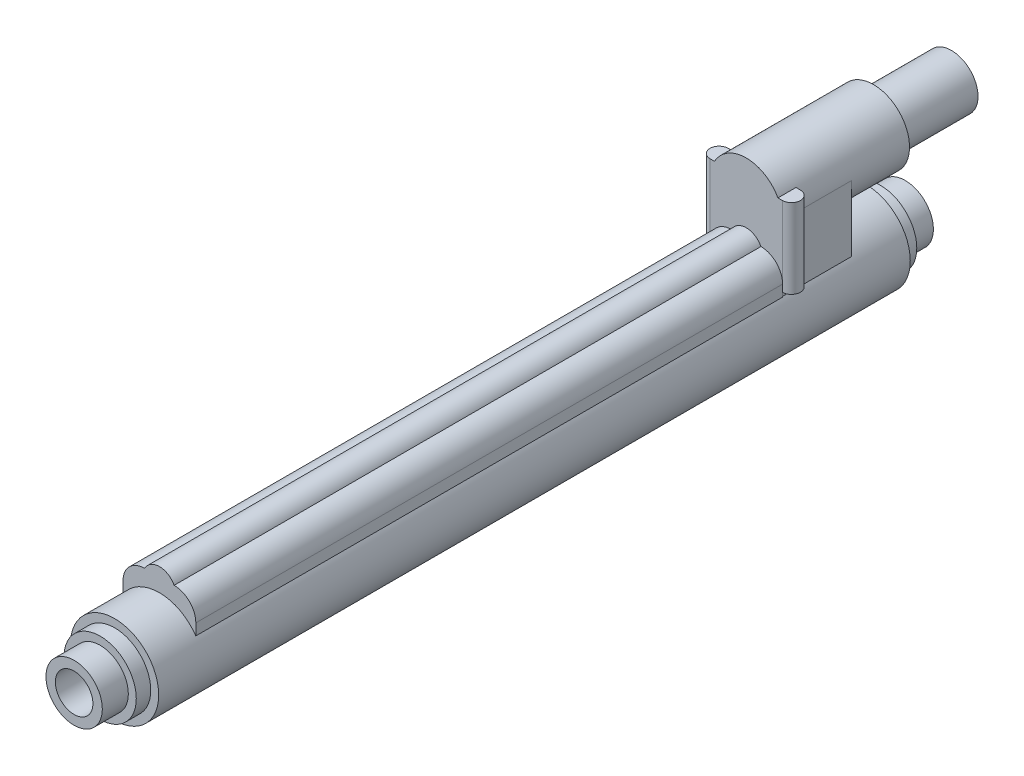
ISO-10303-21;
HEADER;
FILE_DESCRIPTION(('STEP AP214'),'2;1');
FILE_NAME('part.step','',(''),(''),'','','');
FILE_SCHEMA(('AUTOMOTIVE_DESIGN { 1 0 10303 214 1 1 1 1 }'));
ENDSEC;
DATA;
#1=APPLICATION_CONTEXT('core data for automotive mechanical design processes');
#2=APPLICATION_PROTOCOL_DEFINITION('international standard','automotive_design',2000,#1);
#3=PRODUCT_CONTEXT('',#1,'mechanical');
#4=PRODUCT('Part','Part','',(#3));
#5=PRODUCT_RELATED_PRODUCT_CATEGORY('part','',(#4));
#6=PRODUCT_DEFINITION_FORMATION('','',#4);
#7=PRODUCT_DEFINITION_CONTEXT('part definition',#1,'design');
#8=PRODUCT_DEFINITION('design','',#6,#7);
#9=PRODUCT_DEFINITION_SHAPE('','',#8);
#10=(LENGTH_UNIT() NAMED_UNIT(*) SI_UNIT(.MILLI.,.METRE.));
#11=(NAMED_UNIT(*) PLANE_ANGLE_UNIT() SI_UNIT($,.RADIAN.));
#12=(NAMED_UNIT(*) SI_UNIT($,.STERADIAN.) SOLID_ANGLE_UNIT());
#13=UNCERTAINTY_MEASURE_WITH_UNIT(LENGTH_MEASURE(1.E-05),#10,'distance_accuracy_value','');
#14=(GEOMETRIC_REPRESENTATION_CONTEXT(3) GLOBAL_UNCERTAINTY_ASSIGNED_CONTEXT((#13)) GLOBAL_UNIT_ASSIGNED_CONTEXT((#10,
#11,#12)) REPRESENTATION_CONTEXT('',''));
#15=CARTESIAN_POINT('',(0.,0.,0.));
#16=DIRECTION('',(0.,0.,1.));
#17=DIRECTION('',(1.,0.,0.));
#18=AXIS2_PLACEMENT_3D('',#15,#16,#17);
#19=CARTESIAN_POINT('',(6.35,16.002,27.94));
#20=DIRECTION('',(-1.,0.,0.));
#21=DIRECTION('',(0.,0.,1.));
#22=AXIS2_PLACEMENT_3D('',#19,#20,#21);
#23=PLANE('',#22);
#24=DIRECTION('',(0.,-1.,0.));
#25=VECTOR('',#24,1.);
#26=CARTESIAN_POINT('',(6.35000000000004,19.05,24.765));
#27=LINE('',#26,#25);
#28=CARTESIAN_POINT('',(6.35000000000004,16.002,24.765));
#29=VERTEX_POINT('',#28);
#30=CARTESIAN_POINT('',(6.35000000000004,5.08,24.765));
#31=VERTEX_POINT('',#30);
#32=EDGE_CURVE('E165',#29,#31,#27,.T.);
#33=ORIENTED_EDGE('',*,*,#32,.T.);
#34=DIRECTION('',(0.,0.,-1.));
#35=VECTOR('',#34,1.);
#36=CARTESIAN_POINT('',(6.35,5.08,27.94));
#37=LINE('',#36,#35);
#38=CARTESIAN_POINT('',(6.35,5.08,27.94));
#39=VERTEX_POINT('',#38);
#40=EDGE_CURVE('E150',#39,#31,#37,.T.);
#41=ORIENTED_EDGE('',*,*,#40,.F.);
#42=DIRECTION('',(0.,1.,0.));
#43=VECTOR('',#42,1.);
#44=CARTESIAN_POINT('',(6.35,16.002,27.94));
#45=LINE('',#44,#43);
#46=CARTESIAN_POINT('',(6.35,4.43773692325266,27.94));
#47=VERTEX_POINT('',#46);
#48=EDGE_CURVE('E249',#47,#39,#45,.T.);
#49=ORIENTED_EDGE('',*,*,#48,.F.);
#50=DIRECTION('',(0.,0.,-1.));
#51=VECTOR('',#50,1.);
#52=CARTESIAN_POINT('',(6.35,4.43773692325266,27.94));
#53=LINE('',#52,#51);
#54=CARTESIAN_POINT('',(6.35,4.43773692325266,15.748));
#55=VERTEX_POINT('',#54);
#56=EDGE_CURVE('E264',#47,#55,#53,.T.);
#57=ORIENTED_EDGE('',*,*,#56,.T.);
#58=DIRECTION('',(0.,1.,0.));
#59=VECTOR('',#58,1.);
#60=CARTESIAN_POINT('',(6.35,16.002,15.748));
#61=LINE('',#60,#59);
#62=CARTESIAN_POINT('',(6.35,16.002,15.748));
#63=VERTEX_POINT('',#62);
#64=EDGE_CURVE('E243',#55,#63,#61,.T.);
#65=ORIENTED_EDGE('',*,*,#64,.T.);
#66=DIRECTION('',(0.,0.,-1.));
#67=VECTOR('',#66,1.);
#68=CARTESIAN_POINT('',(6.35,16.002,27.94));
#69=LINE('',#68,#67);
#70=EDGE_CURVE('E172',#29,#63,#69,.T.);
#71=ORIENTED_EDGE('',*,*,#70,.F.);
#72=EDGE_LOOP('',(#33,#41,#49,#57,#65,#71));
#73=FACE_BOUND('',#72,.T.);
#74=ADVANCED_FACE('F31',(#73),#23,.F.);
#75=CARTESIAN_POINT('',(0.,16.002,27.94));
#76=DIRECTION('',(0.,0.,-1.));
#77=DIRECTION('',(-1.,0.,0.));
#78=AXIS2_PLACEMENT_3D('',#75,#76,#77);
#79=CYLINDRICAL_SURFACE('',#78,6.35);
#80=CARTESIAN_POINT('',(0.,16.002,5.588));
#81=DIRECTION('',(0.,0.,-1.));
#82=DIRECTION('',(-1.,0.,0.));
#83=AXIS2_PLACEMENT_3D('',#80,#81,#82);
#84=CIRCLE('',#83,6.35);
#85=CARTESIAN_POINT('',(-6.35,16.002,5.588));
#86=VERTEX_POINT('',#85);
#87=EDGE_CURVE('E193',#86,#86,#84,.T.);
#88=ORIENTED_EDGE('',*,*,#87,.F.);
#89=EDGE_LOOP('',(#88));
#90=FACE_BOUND('',#89,.T.);
#91=CARTESIAN_POINT('',(0.,16.002,24.765));
#92=DIRECTION('',(0.,0.,1.));
#93=DIRECTION('',(1.,0.,0.));
#94=AXIS2_PLACEMENT_3D('',#91,#92,#93);
#95=CIRCLE('',#94,6.35);
#96=CARTESIAN_POINT('',(5.57065489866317,19.05,24.765));
#97=VERTEX_POINT('',#96);
#98=EDGE_CURVE('E183',#29,#97,#95,.T.);
#99=ORIENTED_EDGE('',*,*,#98,.F.);
#100=ORIENTED_EDGE('',*,*,#70,.T.);
#101=CARTESIAN_POINT('',(0.,16.002,15.748));
#102=DIRECTION('',(0.,0.,-1.));
#103=DIRECTION('',(-1.,0.,0.));
#104=AXIS2_PLACEMENT_3D('',#101,#102,#103);
#105=CIRCLE('',#104,6.35);
#106=CARTESIAN_POINT('',(-6.35,16.002,15.748));
#107=VERTEX_POINT('',#106);
#108=EDGE_CURVE('E190',#63,#107,#105,.T.);
#109=ORIENTED_EDGE('',*,*,#108,.T.);
#110=DIRECTION('',(0.,0.,-1.));
#111=VECTOR('',#110,1.);
#112=CARTESIAN_POINT('',(-6.35,16.002,27.94));
#113=LINE('',#112,#111);
#114=CARTESIAN_POINT('',(-6.35,16.002,24.765));
#115=VERTEX_POINT('',#114);
#116=EDGE_CURVE('E261',#115,#107,#113,.T.);
#117=ORIENTED_EDGE('',*,*,#116,.F.);
#118=CARTESIAN_POINT('',(-5.57065489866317,19.05,24.765));
#119=VERTEX_POINT('',#118);
#120=EDGE_CURVE('E158',#119,#115,#95,.T.);
#121=ORIENTED_EDGE('',*,*,#120,.F.);
#122=DIRECTION('',(0.,0.,-1.));
#123=VECTOR('',#122,1.);
#124=CARTESIAN_POINT('',(-5.57065489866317,19.05,27.94));
#125=LINE('',#124,#123);
#126=CARTESIAN_POINT('',(-5.57065489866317,19.05,27.94));
#127=VERTEX_POINT('',#126);
#128=EDGE_CURVE('E39',#119,#127,#125,.F.);
#129=ORIENTED_EDGE('',*,*,#128,.T.);
#130=CARTESIAN_POINT('',(0.,16.002,27.94));
#131=DIRECTION('',(0.,0.,1.));
#132=DIRECTION('',(1.,0.,0.));
#133=AXIS2_PLACEMENT_3D('',#130,#131,#132);
#134=CIRCLE('',#133,6.35);
#135=CARTESIAN_POINT('',(5.57065489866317,19.05,27.94));
#136=VERTEX_POINT('',#135);
#137=EDGE_CURVE('E251',#136,#127,#134,.T.);
#138=ORIENTED_EDGE('',*,*,#137,.F.);
#139=DIRECTION('',(0.,0.,-1.));
#140=VECTOR('',#139,1.);
#141=CARTESIAN_POINT('',(5.57065489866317,19.05,27.94));
#142=LINE('',#141,#140);
#143=EDGE_CURVE('E11',#136,#97,#142,.T.);
#144=ORIENTED_EDGE('',*,*,#143,.T.);
#145=EDGE_LOOP('',(#99,#100,#109,#117,#121,#129,#138,#144));
#146=FACE_BOUND('',#145,.T.);
#147=ADVANCED_FACE('F312',(#90,#146),#79,.T.);
#148=CARTESIAN_POINT('',(-6.35,16.002,27.94));
#149=DIRECTION('',(1.,0.,0.));
#150=DIRECTION('',(0.,1.,0.));
#151=AXIS2_PLACEMENT_3D('',#148,#149,#150);
#152=PLANE('',#151);
#153=DIRECTION('',(0.,-1.,0.));
#154=VECTOR('',#153,1.);
#155=CARTESIAN_POINT('',(-6.35,19.05,24.765));
#156=LINE('',#155,#154);
#157=CARTESIAN_POINT('',(-6.35,5.08,24.765));
#158=VERTEX_POINT('',#157);
#159=EDGE_CURVE('E177',#115,#158,#156,.T.);
#160=ORIENTED_EDGE('',*,*,#159,.F.);
#161=ORIENTED_EDGE('',*,*,#116,.T.);
#162=DIRECTION('',(0.,-1.,0.));
#163=VECTOR('',#162,1.);
#164=CARTESIAN_POINT('',(-6.35,16.002,15.748));
#165=LINE('',#164,#163);
#166=CARTESIAN_POINT('',(-6.35,4.43773692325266,15.748));
#167=VERTEX_POINT('',#166);
#168=EDGE_CURVE('E245',#107,#167,#165,.T.);
#169=ORIENTED_EDGE('',*,*,#168,.T.);
#170=DIRECTION('',(0.,0.,-1.));
#171=VECTOR('',#170,1.);
#172=CARTESIAN_POINT('',(-6.35,4.43773692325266,27.94));
#173=LINE('',#172,#171);
#174=CARTESIAN_POINT('',(-6.35,4.43773692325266,27.94));
#175=VERTEX_POINT('',#174);
#176=EDGE_CURVE('E258',#175,#167,#173,.T.);
#177=ORIENTED_EDGE('',*,*,#176,.F.);
#178=DIRECTION('',(0.,-1.,0.));
#179=VECTOR('',#178,1.);
#180=CARTESIAN_POINT('',(-6.35,16.002,27.94));
#181=LINE('',#180,#179);
#182=CARTESIAN_POINT('',(-6.35,5.08,27.94));
#183=VERTEX_POINT('',#182);
#184=EDGE_CURVE('E254',#183,#175,#181,.T.);
#185=ORIENTED_EDGE('',*,*,#184,.F.);
#186=DIRECTION('',(0.,0.,1.));
#187=VECTOR('',#186,1.);
#188=CARTESIAN_POINT('',(-6.35,5.08,27.94));
#189=LINE('',#188,#187);
#190=EDGE_CURVE('E159',#158,#183,#189,.T.);
#191=ORIENTED_EDGE('',*,*,#190,.F.);
#192=EDGE_LOOP('',(#160,#161,#169,#177,#185,#191));
#193=FACE_BOUND('',#192,.T.);
#194=ADVANCED_FACE('F343',(#193),#152,.F.);
#195=CARTESIAN_POINT('',(0.,16.002,5.588));
#196=DIRECTION('',(0.,0.,-1.));
#197=DIRECTION('',(-1.,0.,0.));
#198=AXIS2_PLACEMENT_3D('',#195,#196,#197);
#199=PLANE('',#198);
#200=ORIENTED_EDGE('',*,*,#87,.T.);
#201=EDGE_LOOP('',(#200));
#202=FACE_BOUND('',#201,.T.);
#203=CARTESIAN_POINT('',(0.,16.002,5.588));
#204=DIRECTION('',(0.,0.,-1.));
#205=DIRECTION('',(-1.,0.,0.));
#206=AXIS2_PLACEMENT_3D('',#203,#204,#205);
#207=CIRCLE('',#206,4.6736);
#208=CARTESIAN_POINT('',(-4.6736,16.002,5.588));
#209=VERTEX_POINT('',#208);
#210=EDGE_CURVE('E184',#209,#209,#207,.T.);
#211=ORIENTED_EDGE('',*,*,#210,.F.);
#212=EDGE_LOOP('',(#211));
#213=FACE_BOUND('',#212,.T.);
#214=ADVANCED_FACE('F558',(#202,#213),#199,.T.);
#215=CARTESIAN_POINT('',(0.,16.002,15.748));
#216=DIRECTION('',(0.,0.,1.));
#217=DIRECTION('',(1.,0.,0.));
#218=AXIS2_PLACEMENT_3D('',#215,#216,#217);
#219=PLANE('',#218);
#220=ORIENTED_EDGE('',*,*,#108,.F.);
#221=ORIENTED_EDGE('',*,*,#64,.F.);
#222=CARTESIAN_POINT('',(0.,0.,15.748));
#223=DIRECTION('',(0.,0.,1.));
#224=DIRECTION('',(1.,0.,0.));
#225=AXIS2_PLACEMENT_3D('',#222,#223,#224);
#226=CIRCLE('',#225,7.747);
#227=EDGE_CURVE('E301',#55,#167,#226,.T.);
#228=ORIENTED_EDGE('',*,*,#227,.T.);
#229=ORIENTED_EDGE('',*,*,#168,.F.);
#230=EDGE_LOOP('',(#220,#221,#228,#229));
#231=FACE_BOUND('',#230,.T.);
#232=ADVANCED_FACE('F380',(#231),#219,.F.);
#233=CARTESIAN_POINT('',(0.,16.002,27.94));
#234=DIRECTION('',(0.,0.,1.));
#235=DIRECTION('',(1.,0.,0.));
#236=AXIS2_PLACEMENT_3D('',#233,#234,#235);
#237=PLANE('',#236);
#238=ORIENTED_EDGE('',*,*,#137,.T.);
#239=DIRECTION('',(1.,0.,0.));
#240=VECTOR('',#239,1.);
#241=CARTESIAN_POINT('',(6.35,19.05,27.94));
#242=LINE('',#241,#240);
#243=CARTESIAN_POINT('',(-6.35,19.05,27.94));
#244=VERTEX_POINT('',#243);
#245=EDGE_CURVE('E320',#244,#127,#242,.T.);
#246=ORIENTED_EDGE('',*,*,#245,.F.);
#247=CARTESIAN_POINT('',(-6.35,6.96999131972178,27.94));
#248=VERTEX_POINT('',#247);
#249=EDGE_CURVE('E255',#244,#248,#181,.T.);
#250=ORIENTED_EDGE('',*,*,#249,.T.);
#251=CARTESIAN_POINT('',(-2.59078322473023,6.34999999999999,27.94));
#252=DIRECTION('',(0.,0.,1.));
#253=DIRECTION('',(-1.,0.,0.));
#254=AXIS2_PLACEMENT_3D('',#251,#252,#253);
#255=CIRCLE('',#254,3.81);
#256=CARTESIAN_POINT('',(-2.59078322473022,10.16,27.94));
#257=VERTEX_POINT('',#256);
#258=EDGE_CURVE('E204',#257,#248,#255,.T.);
#259=ORIENTED_EDGE('',*,*,#258,.F.);
#260=CARTESIAN_POINT('',(0.,8.79841256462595,27.94));
#261=DIRECTION('',(0.,0.,1.));
#262=DIRECTION('',(-1.,0.,0.));
#263=AXIS2_PLACEMENT_3D('',#260,#261,#262);
#264=CIRCLE('',#263,2.92678630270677);
#265=CARTESIAN_POINT('',(2.59078322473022,10.16,27.94));
#266=VERTEX_POINT('',#265);
#267=EDGE_CURVE('E200',#266,#257,#264,.T.);
#268=ORIENTED_EDGE('',*,*,#267,.F.);
#269=CARTESIAN_POINT('',(2.59078322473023,6.34999999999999,27.94));
#270=DIRECTION('',(0.,0.,1.));
#271=DIRECTION('',(1.,0.,0.));
#272=AXIS2_PLACEMENT_3D('',#269,#270,#271);
#273=CIRCLE('',#272,3.81);
#274=CARTESIAN_POINT('',(6.35,6.96999131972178,27.94));
#275=VERTEX_POINT('',#274);
#276=EDGE_CURVE('E196',#275,#266,#273,.T.);
#277=ORIENTED_EDGE('',*,*,#276,.F.);
#278=CARTESIAN_POINT('',(6.35,19.05,27.94));
#279=VERTEX_POINT('',#278);
#280=EDGE_CURVE('E248',#275,#279,#45,.T.);
#281=ORIENTED_EDGE('',*,*,#280,.T.);
#282=EDGE_CURVE('E322',#136,#279,#242,.T.);
#283=ORIENTED_EDGE('',*,*,#282,.F.);
#284=EDGE_LOOP('',(#238,#246,#250,#259,#268,#277,#281,#283));
#285=FACE_BOUND('',#284,.T.);
#286=ADVANCED_FACE('F319',(#285),#237,.T.);
#287=CARTESIAN_POINT('',(0.,0.,138.938));
#288=DIRECTION('',(0.,0.,1.));
#289=DIRECTION('',(1.,0.,0.));
#290=AXIS2_PLACEMENT_3D('',#287,#288,#289);
#291=PLANE('',#290);
#292=CARTESIAN_POINT('',(0.,0.,138.938));
#293=DIRECTION('',(0.,0.,1.));
#294=DIRECTION('',(1.,0.,0.));
#295=AXIS2_PLACEMENT_3D('',#292,#293,#294);
#296=CIRCLE('',#295,7.747);
#297=CARTESIAN_POINT('',(7.747,0.,138.938));
#298=VERTEX_POINT('',#297);
#299=EDGE_CURVE('E287',#298,#298,#296,.T.);
#300=ORIENTED_EDGE('',*,*,#299,.T.);
#301=EDGE_LOOP('',(#300));
#302=FACE_BOUND('',#301,.T.);
#303=CARTESIAN_POINT('',(0.,0.,138.938));
#304=DIRECTION('',(0.,0.,1.));
#305=DIRECTION('',(1.,0.,0.));
#306=AXIS2_PLACEMENT_3D('',#303,#304,#305);
#307=CIRCLE('',#306,6.35);
#308=CARTESIAN_POINT('',(6.35,0.,138.938));
#309=VERTEX_POINT('',#308);
#310=EDGE_CURVE('E273',#309,#309,#307,.T.);
#311=ORIENTED_EDGE('',*,*,#310,.F.);
#312=EDGE_LOOP('',(#311));
#313=FACE_BOUND('',#312,.T.);
#314=ADVANCED_FACE('F435',(#302,#313),#291,.T.);
#315=CARTESIAN_POINT('',(0.,0.,6.858));
#316=DIRECTION('',(0.,0.,1.));
#317=DIRECTION('',(1.,0.,0.));
#318=AXIS2_PLACEMENT_3D('',#315,#316,#317);
#319=PLANE('',#318);
#320=CARTESIAN_POINT('',(0.,0.,6.858));
#321=DIRECTION('',(0.,0.,1.));
#322=DIRECTION('',(1.,0.,0.));
#323=AXIS2_PLACEMENT_3D('',#320,#321,#322);
#324=CIRCLE('',#323,7.747);
#325=CARTESIAN_POINT('',(7.747,0.,6.858));
#326=VERTEX_POINT('',#325);
#327=EDGE_CURVE('E284',#326,#326,#324,.T.);
#328=ORIENTED_EDGE('',*,*,#327,.F.);
#329=EDGE_LOOP('',(#328));
#330=FACE_BOUND('',#329,.T.);
#331=CARTESIAN_POINT('',(0.,0.,6.858));
#332=DIRECTION('',(0.,0.,1.));
#333=DIRECTION('',(1.,0.,0.));
#334=AXIS2_PLACEMENT_3D('',#331,#332,#333);
#335=CIRCLE('',#334,6.35);
#336=CARTESIAN_POINT('',(6.35,0.,6.858));
#337=VERTEX_POINT('',#336);
#338=EDGE_CURVE('E296',#337,#337,#335,.F.);
#339=ORIENTED_EDGE('',*,*,#338,.F.);
#340=EDGE_LOOP('',(#339));
#341=FACE_BOUND('',#340,.T.);
#342=ADVANCED_FACE('F432',(#330,#341),#319,.F.);
#343=CARTESIAN_POINT('',(0.,0.,138.938));
#344=DIRECTION('',(0.,0.,-1.));
#345=DIRECTION('',(-1.,0.,0.));
#346=AXIS2_PLACEMENT_3D('',#343,#344,#345);
#347=CYLINDRICAL_SURFACE('',#346,7.747);
#348=DIRECTION('',(0.,0.,-1.));
#349=VECTOR('',#348,1.);
#350=CARTESIAN_POINT('',(6.40078322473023,4.36417038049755,131.064));
#351=LINE('',#350,#349);
#352=CARTESIAN_POINT('',(6.40078322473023,4.36417038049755,131.064));
#353=VERTEX_POINT('',#352);
#354=CARTESIAN_POINT('',(6.40078322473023,4.36417038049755,27.94));
#355=VERTEX_POINT('',#354);
#356=EDGE_CURVE('E54',#353,#355,#351,.T.);
#357=ORIENTED_EDGE('',*,*,#356,.F.);
#358=CARTESIAN_POINT('',(0.,0.,131.064));
#359=DIRECTION('',(0.,0.,1.));
#360=DIRECTION('',(1.,0.,0.));
#361=AXIS2_PLACEMENT_3D('',#358,#359,#360);
#362=CIRCLE('',#361,7.747);
#363=CARTESIAN_POINT('',(-6.40078322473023,4.36417038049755,131.064));
#364=VERTEX_POINT('',#363);
#365=EDGE_CURVE('E306',#353,#364,#362,.T.);
#366=ORIENTED_EDGE('',*,*,#365,.T.);
#367=DIRECTION('',(0.,0.,-1.));
#368=VECTOR('',#367,1.);
#369=CARTESIAN_POINT('',(-6.40078322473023,4.36417038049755,131.064));
#370=LINE('',#369,#368);
#371=CARTESIAN_POINT('',(-6.40078322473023,4.36417038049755,27.94));
#372=VERTEX_POINT('',#371);
#373=EDGE_CURVE('E228',#364,#372,#370,.T.);
#374=ORIENTED_EDGE('',*,*,#373,.T.);
#375=CARTESIAN_POINT('',(0.,0.,27.94));
#376=DIRECTION('',(0.,0.,1.));
#377=DIRECTION('',(1.,0.,0.));
#378=AXIS2_PLACEMENT_3D('',#375,#376,#377);
#379=CIRCLE('',#378,7.747);
#380=EDGE_CURVE('E239',#175,#372,#379,.T.);
#381=ORIENTED_EDGE('',*,*,#380,.F.);
#382=ORIENTED_EDGE('',*,*,#176,.T.);
#383=ORIENTED_EDGE('',*,*,#227,.F.);
#384=ORIENTED_EDGE('',*,*,#56,.F.);
#385=EDGE_CURVE('E242',#355,#47,#379,.T.);
#386=ORIENTED_EDGE('',*,*,#385,.F.);
#387=EDGE_LOOP('',(#357,#366,#374,#381,#382,#383,#384,#386));
#388=FACE_BOUND('',#387,.T.);
#389=ORIENTED_EDGE('',*,*,#299,.F.);
#390=EDGE_LOOP('',(#389));
#391=FACE_BOUND('',#390,.T.);
#392=ORIENTED_EDGE('',*,*,#327,.T.);
#393=EDGE_LOOP('',(#392));
#394=FACE_BOUND('',#393,.T.);
#395=ADVANCED_FACE('F375',(#388,#391,#394),#347,.T.);
#396=CARTESIAN_POINT('',(0.,0.,4.318));
#397=DIRECTION('',(0.,0.,-1.));
#398=DIRECTION('',(-1.,0.,0.));
#399=AXIS2_PLACEMENT_3D('',#396,#397,#398);
#400=PLANE('',#399);
#401=CARTESIAN_POINT('',(0.,0.,4.318));
#402=DIRECTION('',(0.,0.,-1.));
#403=DIRECTION('',(-1.,0.,0.));
#404=AXIS2_PLACEMENT_3D('',#401,#402,#403);
#405=CIRCLE('',#404,6.35);
#406=CARTESIAN_POINT('',(-6.35,0.,4.318));
#407=VERTEX_POINT('',#406);
#408=EDGE_CURVE('E280',#407,#407,#405,.T.);
#409=ORIENTED_EDGE('',*,*,#408,.T.);
#410=EDGE_LOOP('',(#409));
#411=FACE_BOUND('',#410,.T.);
#412=CARTESIAN_POINT('',(0.,0.,4.31799999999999));
#413=DIRECTION('',(0.,0.,-1.));
#414=DIRECTION('',(-1.,0.,0.));
#415=AXIS2_PLACEMENT_3D('',#412,#413,#414);
#416=CIRCLE('',#415,4.953);
#417=CARTESIAN_POINT('',(-4.953,0.,4.31799999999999));
#418=VERTEX_POINT('',#417);
#419=EDGE_CURVE('E283',#418,#418,#416,.T.);
#420=ORIENTED_EDGE('',*,*,#419,.F.);
#421=EDGE_LOOP('',(#420));
#422=FACE_BOUND('',#421,.T.);
#423=ADVANCED_FACE('F423',(#411,#422),#400,.T.);
#424=CARTESIAN_POINT('',(0.,0.,4.318));
#425=DIRECTION('',(0.,0.,1.));
#426=DIRECTION('',(1.,0.,0.));
#427=AXIS2_PLACEMENT_3D('',#424,#425,#426);
#428=CYLINDRICAL_SURFACE('',#427,6.35);
#429=ORIENTED_EDGE('',*,*,#408,.F.);
#430=EDGE_LOOP('',(#429));
#431=FACE_BOUND('',#430,.T.);
#432=ORIENTED_EDGE('',*,*,#338,.T.);
#433=EDGE_LOOP('',(#432));
#434=FACE_BOUND('',#433,.T.);
#435=ADVANCED_FACE('F426',(#431,#434),#428,.T.);
#436=CARTESIAN_POINT('',(0.,0.,0.));
#437=DIRECTION('',(0.,0.,1.));
#438=DIRECTION('',(1.,0.,0.));
#439=AXIS2_PLACEMENT_3D('',#436,#437,#438);
#440=PLANE('',#439);
#441=CARTESIAN_POINT('',(0.,0.,0.));
#442=DIRECTION('',(0.,0.,-1.));
#443=DIRECTION('',(-1.,0.,0.));
#444=AXIS2_PLACEMENT_3D('',#441,#442,#443);
#445=CIRCLE('',#444,3.302);
#446=CARTESIAN_POINT('',(-3.302,0.,0.));
#447=VERTEX_POINT('',#446);
#448=EDGE_CURVE('E267',#447,#447,#445,.T.);
#449=ORIENTED_EDGE('',*,*,#448,.F.);
#450=EDGE_LOOP('',(#449));
#451=FACE_BOUND('',#450,.T.);
#452=CARTESIAN_POINT('',(0.,0.,0.));
#453=DIRECTION('',(0.,0.,1.));
#454=DIRECTION('',(1.,0.,0.));
#455=AXIS2_PLACEMENT_3D('',#452,#453,#454);
#456=CIRCLE('',#455,4.953);
#457=CARTESIAN_POINT('',(4.953,0.,0.));
#458=VERTEX_POINT('',#457);
#459=EDGE_CURVE('E290',#458,#458,#456,.T.);
#460=ORIENTED_EDGE('',*,*,#459,.F.);
#461=EDGE_LOOP('',(#460));
#462=FACE_BOUND('',#461,.T.);
#463=ADVANCED_FACE('F430',(#451,#462),#440,.F.);
#464=CARTESIAN_POINT('',(0.,0.,146.05));
#465=DIRECTION('',(0.,0.,-1.));
#466=DIRECTION('',(-1.,0.,0.));
#467=AXIS2_PLACEMENT_3D('',#464,#465,#466);
#468=CYLINDRICAL_SURFACE('',#467,4.953);
#469=ORIENTED_EDGE('',*,*,#419,.T.);
#470=EDGE_LOOP('',(#469));
#471=FACE_BOUND('',#470,.T.);
#472=ORIENTED_EDGE('',*,*,#459,.T.);
#473=EDGE_LOOP('',(#472));
#474=FACE_BOUND('',#473,.T.);
#475=ADVANCED_FACE('F417',(#471,#474),#468,.T.);
#476=CARTESIAN_POINT('',(0.,0.,141.478));
#477=DIRECTION('',(0.,0.,1.));
#478=DIRECTION('',(1.,0.,0.));
#479=AXIS2_PLACEMENT_3D('',#476,#477,#478);
#480=PLANE('',#479);
#481=CARTESIAN_POINT('',(0.,0.,141.478));
#482=DIRECTION('',(0.,0.,1.));
#483=DIRECTION('',(1.,0.,0.));
#484=AXIS2_PLACEMENT_3D('',#481,#482,#483);
#485=CIRCLE('',#484,6.35);
#486=CARTESIAN_POINT('',(6.35,0.,141.478));
#487=VERTEX_POINT('',#486);
#488=EDGE_CURVE('E276',#487,#487,#485,.T.);
#489=ORIENTED_EDGE('',*,*,#488,.T.);
#490=EDGE_LOOP('',(#489));
#491=FACE_BOUND('',#490,.T.);
#492=CARTESIAN_POINT('',(0.,0.,141.478));
#493=DIRECTION('',(0.,0.,1.));
#494=DIRECTION('',(1.,0.,0.));
#495=AXIS2_PLACEMENT_3D('',#492,#493,#494);
#496=CIRCLE('',#495,4.953);
#497=CARTESIAN_POINT('',(4.953,0.,141.478));
#498=VERTEX_POINT('',#497);
#499=EDGE_CURVE('E279',#498,#498,#496,.T.);
#500=ORIENTED_EDGE('',*,*,#499,.F.);
#501=EDGE_LOOP('',(#500));
#502=FACE_BOUND('',#501,.T.);
#503=ADVANCED_FACE('F413',(#491,#502),#480,.T.);
#504=CARTESIAN_POINT('',(0.,0.,141.478));
#505=DIRECTION('',(0.,0.,-1.));
#506=DIRECTION('',(-1.,0.,0.));
#507=AXIS2_PLACEMENT_3D('',#504,#505,#506);
#508=CYLINDRICAL_SURFACE('',#507,6.35);
#509=ORIENTED_EDGE('',*,*,#488,.F.);
#510=EDGE_LOOP('',(#509));
#511=FACE_BOUND('',#510,.T.);
#512=ORIENTED_EDGE('',*,*,#310,.T.);
#513=EDGE_LOOP('',(#512));
#514=FACE_BOUND('',#513,.T.);
#515=ADVANCED_FACE('F416',(#511,#514),#508,.T.);
#516=CARTESIAN_POINT('',(0.,0.,146.05));
#517=DIRECTION('',(0.,0.,1.));
#518=DIRECTION('',(1.,0.,0.));
#519=AXIS2_PLACEMENT_3D('',#516,#517,#518);
#520=PLANE('',#519);
#521=CARTESIAN_POINT('',(0.,0.,146.05));
#522=DIRECTION('',(0.,0.,-1.));
#523=DIRECTION('',(-1.,0.,0.));
#524=AXIS2_PLACEMENT_3D('',#521,#522,#523);
#525=CIRCLE('',#524,3.302);
#526=CARTESIAN_POINT('',(-3.302,0.,146.05));
#527=VERTEX_POINT('',#526);
#528=EDGE_CURVE('E270',#527,#527,#525,.T.);
#529=ORIENTED_EDGE('',*,*,#528,.T.);
#530=EDGE_LOOP('',(#529));
#531=FACE_BOUND('',#530,.T.);
#532=CARTESIAN_POINT('',(0.,0.,146.05));
#533=DIRECTION('',(0.,0.,1.));
#534=DIRECTION('',(1.,0.,0.));
#535=AXIS2_PLACEMENT_3D('',#532,#533,#534);
#536=CIRCLE('',#535,4.953);
#537=CARTESIAN_POINT('',(4.953,0.,146.05));
#538=VERTEX_POINT('',#537);
#539=EDGE_CURVE('E293',#538,#538,#536,.T.);
#540=ORIENTED_EDGE('',*,*,#539,.T.);
#541=EDGE_LOOP('',(#540));
#542=FACE_BOUND('',#541,.T.);
#543=ADVANCED_FACE('F421',(#531,#542),#520,.T.);
#544=ORIENTED_EDGE('',*,*,#499,.T.);
#545=EDGE_LOOP('',(#544));
#546=FACE_BOUND('',#545,.T.);
#547=ORIENTED_EDGE('',*,*,#539,.F.);
#548=EDGE_LOOP('',(#547));
#549=FACE_BOUND('',#548,.T.);
#550=ADVANCED_FACE('F33',(#546,#549),#468,.T.);
#551=CARTESIAN_POINT('',(0.,0.,146.05));
#552=DIRECTION('',(0.,0.,-1.));
#553=DIRECTION('',(-1.,0.,0.));
#554=AXIS2_PLACEMENT_3D('',#551,#552,#553);
#555=CYLINDRICAL_SURFACE('',#554,3.302);
#556=ORIENTED_EDGE('',*,*,#528,.F.);
#557=EDGE_LOOP('',(#556));
#558=FACE_BOUND('',#557,.T.);
#559=ORIENTED_EDGE('',*,*,#448,.T.);
#560=EDGE_LOOP('',(#559));
#561=FACE_BOUND('',#560,.T.);
#562=ADVANCED_FACE('F409',(#558,#561),#555,.F.);
#563=CARTESIAN_POINT('',(2.59078322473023,6.34999999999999,131.064));
#564=DIRECTION('',(0.,0.,1.));
#565=DIRECTION('',(1.,0.,0.));
#566=AXIS2_PLACEMENT_3D('',#563,#564,#565);
#567=PLANE('',#566);
#568=ORIENTED_EDGE('',*,*,#365,.F.);
#569=DIRECTION('',(0.,1.,0.));
#570=VECTOR('',#569,1.);
#571=CARTESIAN_POINT('',(6.40078322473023,4.36417038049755,131.064));
#572=LINE('',#571,#570);
#573=CARTESIAN_POINT('',(6.40078322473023,6.34999999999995,131.064));
#574=VERTEX_POINT('',#573);
#575=EDGE_CURVE('E222',#353,#574,#572,.T.);
#576=ORIENTED_EDGE('',*,*,#575,.T.);
#577=CARTESIAN_POINT('',(2.59078322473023,6.34999999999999,131.064));
#578=DIRECTION('',(0.,0.,1.));
#579=DIRECTION('',(1.,0.,0.));
#580=AXIS2_PLACEMENT_3D('',#577,#578,#579);
#581=CIRCLE('',#580,3.81);
#582=CARTESIAN_POINT('',(2.59078322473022,10.16,131.064));
#583=VERTEX_POINT('',#582);
#584=EDGE_CURVE('E212',#574,#583,#581,.T.);
#585=ORIENTED_EDGE('',*,*,#584,.T.);
#586=CARTESIAN_POINT('',(0.,8.79841256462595,131.064));
#587=DIRECTION('',(0.,0.,1.));
#588=DIRECTION('',(-1.,0.,0.));
#589=AXIS2_PLACEMENT_3D('',#586,#587,#588);
#590=CIRCLE('',#589,2.92678630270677);
#591=CARTESIAN_POINT('',(-2.59078322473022,10.16,131.064));
#592=VERTEX_POINT('',#591);
#593=EDGE_CURVE('E215',#583,#592,#590,.T.);
#594=ORIENTED_EDGE('',*,*,#593,.T.);
#595=CARTESIAN_POINT('',(-2.59078322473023,6.34999999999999,131.064));
#596=DIRECTION('',(0.,0.,1.));
#597=DIRECTION('',(-1.,0.,0.));
#598=AXIS2_PLACEMENT_3D('',#595,#596,#597);
#599=CIRCLE('',#598,3.81);
#600=CARTESIAN_POINT('',(-6.40078322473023,6.34999999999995,131.064));
#601=VERTEX_POINT('',#600);
#602=EDGE_CURVE('E217',#592,#601,#599,.T.);
#603=ORIENTED_EDGE('',*,*,#602,.T.);
#604=DIRECTION('',(0.,-1.,0.));
#605=VECTOR('',#604,1.);
#606=CARTESIAN_POINT('',(-6.40078322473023,4.36417038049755,131.064));
#607=LINE('',#606,#605);
#608=EDGE_CURVE('E219',#601,#364,#607,.T.);
#609=ORIENTED_EDGE('',*,*,#608,.T.);
#610=EDGE_LOOP('',(#568,#576,#585,#594,#603,#609));
#611=FACE_BOUND('',#610,.T.);
#612=ADVANCED_FACE('F362',(#611),#567,.T.);
#613=CARTESIAN_POINT('',(2.59078322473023,6.34999999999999,27.94));
#614=DIRECTION('',(0.,0.,1.));
#615=DIRECTION('',(1.,0.,0.));
#616=AXIS2_PLACEMENT_3D('',#613,#614,#615);
#617=PLANE('',#616);
#618=DIRECTION('',(0.,1.,0.));
#619=VECTOR('',#618,1.);
#620=CARTESIAN_POINT('',(6.40078322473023,4.36417038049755,27.94));
#621=LINE('',#620,#619);
#622=CARTESIAN_POINT('',(6.40078322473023,6.34999999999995,27.94));
#623=VERTEX_POINT('',#622);
#624=EDGE_CURVE('E210',#355,#623,#621,.T.);
#625=ORIENTED_EDGE('',*,*,#624,.F.);
#626=ORIENTED_EDGE('',*,*,#385,.T.);
#627=ORIENTED_EDGE('',*,*,#48,.T.);
#628=DIRECTION('',(0.,-1.,0.));
#629=VECTOR('',#628,1.);
#630=CARTESIAN_POINT('',(6.35,19.05,27.94));
#631=LINE('',#630,#629);
#632=EDGE_CURVE('E168',#275,#39,#631,.T.);
#633=ORIENTED_EDGE('',*,*,#632,.F.);
#634=EDGE_CURVE('E197',#623,#275,#273,.T.);
#635=ORIENTED_EDGE('',*,*,#634,.F.);
#636=EDGE_LOOP('',(#625,#626,#627,#633,#635));
#637=FACE_BOUND('',#636,.T.);
#638=ADVANCED_FACE('F372',(#637),#617,.F.);
#639=EDGE_CURVE('E259',#248,#183,#181,.T.);
#640=ORIENTED_EDGE('',*,*,#639,.T.);
#641=ORIENTED_EDGE('',*,*,#184,.T.);
#642=ORIENTED_EDGE('',*,*,#380,.T.);
#643=DIRECTION('',(0.,-1.,0.));
#644=VECTOR('',#643,1.);
#645=CARTESIAN_POINT('',(-6.40078322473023,4.36417038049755,27.94));
#646=LINE('',#645,#644);
#647=CARTESIAN_POINT('',(-6.40078322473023,6.34999999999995,27.94));
#648=VERTEX_POINT('',#647);
#649=EDGE_CURVE('E207',#648,#372,#646,.T.);
#650=ORIENTED_EDGE('',*,*,#649,.F.);
#651=EDGE_CURVE('E203',#248,#648,#255,.T.);
#652=ORIENTED_EDGE('',*,*,#651,.F.);
#653=EDGE_LOOP('',(#640,#641,#642,#650,#652));
#654=FACE_BOUND('',#653,.T.);
#655=ADVANCED_FACE('F349',(#654),#617,.F.);
#656=CARTESIAN_POINT('',(2.59078322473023,6.34999999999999,131.064));
#657=DIRECTION('',(0.,0.,-1.));
#658=DIRECTION('',(-1.,0.,0.));
#659=AXIS2_PLACEMENT_3D('',#656,#657,#658);
#660=CYLINDRICAL_SURFACE('',#659,3.81);
#661=ORIENTED_EDGE('',*,*,#634,.T.);
#662=ORIENTED_EDGE('',*,*,#276,.T.);
#663=DIRECTION('',(0.,0.,-1.));
#664=VECTOR('',#663,1.);
#665=CARTESIAN_POINT('',(2.59078322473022,10.16,131.064));
#666=LINE('',#665,#664);
#667=EDGE_CURVE('E236',#583,#266,#666,.T.);
#668=ORIENTED_EDGE('',*,*,#667,.F.);
#669=ORIENTED_EDGE('',*,*,#584,.F.);
#670=DIRECTION('',(0.,0.,-1.));
#671=VECTOR('',#670,1.);
#672=CARTESIAN_POINT('',(6.40078322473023,6.34999999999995,131.064));
#673=LINE('',#672,#671);
#674=EDGE_CURVE('E224',#574,#623,#673,.T.);
#675=ORIENTED_EDGE('',*,*,#674,.T.);
#676=EDGE_LOOP('',(#661,#662,#668,#669,#675));
#677=FACE_BOUND('',#676,.T.);
#678=ADVANCED_FACE('F368',(#677),#660,.T.);
#679=CARTESIAN_POINT('',(0.,8.79841256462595,131.064));
#680=DIRECTION('',(0.,0.,-1.));
#681=DIRECTION('',(-1.,0.,0.));
#682=AXIS2_PLACEMENT_3D('',#679,#680,#681);
#683=CYLINDRICAL_SURFACE('',#682,2.92678630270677);
#684=ORIENTED_EDGE('',*,*,#267,.T.);
#685=DIRECTION('',(0.,0.,-1.));
#686=VECTOR('',#685,1.);
#687=CARTESIAN_POINT('',(-2.59078322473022,10.16,131.064));
#688=LINE('',#687,#686);
#689=EDGE_CURVE('E233',#592,#257,#688,.T.);
#690=ORIENTED_EDGE('',*,*,#689,.F.);
#691=ORIENTED_EDGE('',*,*,#593,.F.);
#692=ORIENTED_EDGE('',*,*,#667,.T.);
#693=EDGE_LOOP('',(#684,#690,#691,#692));
#694=FACE_BOUND('',#693,.T.);
#695=ADVANCED_FACE('F355',(#694),#683,.T.);
#696=CARTESIAN_POINT('',(-2.59078322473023,6.34999999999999,131.064));
#697=DIRECTION('',(0.,0.,-1.));
#698=DIRECTION('',(-1.,0.,0.));
#699=AXIS2_PLACEMENT_3D('',#696,#697,#698);
#700=CYLINDRICAL_SURFACE('',#699,3.81);
#701=ORIENTED_EDGE('',*,*,#258,.T.);
#702=ORIENTED_EDGE('',*,*,#651,.T.);
#703=DIRECTION('',(0.,0.,-1.));
#704=VECTOR('',#703,1.);
#705=CARTESIAN_POINT('',(-6.40078322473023,6.34999999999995,131.064));
#706=LINE('',#705,#704);
#707=EDGE_CURVE('E230',#601,#648,#706,.T.);
#708=ORIENTED_EDGE('',*,*,#707,.F.);
#709=ORIENTED_EDGE('',*,*,#602,.F.);
#710=ORIENTED_EDGE('',*,*,#689,.T.);
#711=EDGE_LOOP('',(#701,#702,#708,#709,#710));
#712=FACE_BOUND('',#711,.T.);
#713=ADVANCED_FACE('F358',(#712),#700,.T.);
#714=CARTESIAN_POINT('',(-6.40078322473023,4.36417038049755,131.064));
#715=DIRECTION('',(1.,0.,0.));
#716=DIRECTION('',(0.,1.,0.));
#717=AXIS2_PLACEMENT_3D('',#714,#715,#716);
#718=PLANE('',#717);
#719=ORIENTED_EDGE('',*,*,#649,.T.);
#720=ORIENTED_EDGE('',*,*,#373,.F.);
#721=ORIENTED_EDGE('',*,*,#608,.F.);
#722=ORIENTED_EDGE('',*,*,#707,.T.);
#723=EDGE_LOOP('',(#719,#720,#721,#722));
#724=FACE_BOUND('',#723,.T.);
#725=ADVANCED_FACE('F532',(#724),#718,.F.);
#726=CARTESIAN_POINT('',(6.40078322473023,4.36417038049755,131.064));
#727=DIRECTION('',(-1.,0.,0.));
#728=DIRECTION('',(0.,-1.,0.));
#729=AXIS2_PLACEMENT_3D('',#726,#727,#728);
#730=PLANE('',#729);
#731=ORIENTED_EDGE('',*,*,#624,.T.);
#732=ORIENTED_EDGE('',*,*,#674,.F.);
#733=ORIENTED_EDGE('',*,*,#575,.F.);
#734=ORIENTED_EDGE('',*,*,#356,.T.);
#735=EDGE_LOOP('',(#731,#732,#733,#734));
#736=FACE_BOUND('',#735,.T.);
#737=ADVANCED_FACE('F537',(#736),#730,.F.);
#738=CARTESIAN_POINT('',(0.,16.002,-8.128));
#739=DIRECTION('',(0.,0.,1.));
#740=DIRECTION('',(1.,0.,0.));
#741=AXIS2_PLACEMENT_3D('',#738,#739,#740);
#742=CYLINDRICAL_SURFACE('',#741,4.6736);
#743=CARTESIAN_POINT('',(0.,16.002,-8.128));
#744=DIRECTION('',(0.,0.,-1.));
#745=DIRECTION('',(-1.,0.,0.));
#746=AXIS2_PLACEMENT_3D('',#743,#744,#745);
#747=CIRCLE('',#746,4.6736);
#748=CARTESIAN_POINT('',(-4.6736,16.002,-8.128));
#749=VERTEX_POINT('',#748);
#750=EDGE_CURVE('E187',#749,#749,#747,.T.);
#751=ORIENTED_EDGE('',*,*,#750,.F.);
#752=EDGE_LOOP('',(#751));
#753=FACE_BOUND('',#752,.T.);
#754=ORIENTED_EDGE('',*,*,#210,.T.);
#755=EDGE_LOOP('',(#754));
#756=FACE_BOUND('',#755,.T.);
#757=ADVANCED_FACE('F547',(#753,#756),#742,.T.);
#758=CARTESIAN_POINT('',(0.,16.002,-8.128));
#759=DIRECTION('',(0.,0.,-1.));
#760=DIRECTION('',(-1.,0.,0.));
#761=AXIS2_PLACEMENT_3D('',#758,#759,#760);
#762=PLANE('',#761);
#763=ORIENTED_EDGE('',*,*,#750,.T.);
#764=EDGE_LOOP('',(#763));
#765=FACE_BOUND('',#764,.T.);
#766=ADVANCED_FACE('F577',(#765),#762,.T.);
#767=CARTESIAN_POINT('',(-6.35,19.05,26.3525));
#768=DIRECTION('',(0.,-1.,0.));
#769=DIRECTION('',(0.,0.,-1.));
#770=AXIS2_PLACEMENT_3D('',#767,#768,#769);
#771=CYLINDRICAL_SURFACE('',#770,1.5875);
#772=CARTESIAN_POINT('',(-6.35,19.05,24.765));
#773=VERTEX_POINT('',#772);
#774=EDGE_CURVE('E174',#773,#115,#156,.T.);
#775=ORIENTED_EDGE('',*,*,#774,.T.);
#776=ORIENTED_EDGE('',*,*,#159,.T.);
#777=CARTESIAN_POINT('',(-6.35,5.08,26.3525));
#778=DIRECTION('',(0.,1.,0.));
#779=DIRECTION('',(0.,0.,1.));
#780=AXIS2_PLACEMENT_3D('',#777,#778,#779);
#781=CIRCLE('',#780,1.5875);
#782=EDGE_CURVE('E46',#158,#183,#781,.T.);
#783=ORIENTED_EDGE('',*,*,#782,.T.);
#784=ORIENTED_EDGE('',*,*,#639,.F.);
#785=ORIENTED_EDGE('',*,*,#249,.F.);
#786=CARTESIAN_POINT('',(-6.35,19.05,26.3525));
#787=DIRECTION('',(0.,1.,0.));
#788=DIRECTION('',(0.,0.,1.));
#789=AXIS2_PLACEMENT_3D('',#786,#787,#788);
#790=CIRCLE('',#789,1.5875);
#791=EDGE_CURVE('E326',#773,#244,#790,.T.);
#792=ORIENTED_EDGE('',*,*,#791,.F.);
#793=EDGE_LOOP('',(#775,#776,#783,#784,#785,#792));
#794=FACE_BOUND('',#793,.T.);
#795=ADVANCED_FACE('F333',(#794),#771,.T.);
#796=CARTESIAN_POINT('',(6.35,5.08,26.3525));
#797=DIRECTION('',(0.,1.,0.));
#798=DIRECTION('',(0.,0.,1.));
#799=AXIS2_PLACEMENT_3D('',#796,#797,#798);
#800=PLANE('',#799);
#801=ORIENTED_EDGE('',*,*,#782,.F.);
#802=ORIENTED_EDGE('',*,*,#190,.T.);
#803=EDGE_LOOP('',(#801,#802));
#804=FACE_BOUND('',#803,.T.);
#805=ADVANCED_FACE('F339',(#804),#800,.F.);
#806=CARTESIAN_POINT('',(6.35,19.05,26.3525));
#807=DIRECTION('',(0.,1.,0.));
#808=DIRECTION('',(0.,0.,1.));
#809=AXIS2_PLACEMENT_3D('',#806,#807,#808);
#810=PLANE('',#809);
#811=ORIENTED_EDGE('',*,*,#128,.F.);
#812=DIRECTION('',(-1.,0.,0.));
#813=VECTOR('',#812,1.);
#814=CARTESIAN_POINT('',(-6.35,19.05,24.765));
#815=LINE('',#814,#813);
#816=EDGE_CURVE('E385',#119,#773,#815,.T.);
#817=ORIENTED_EDGE('',*,*,#816,.T.);
#818=ORIENTED_EDGE('',*,*,#791,.T.);
#819=ORIENTED_EDGE('',*,*,#245,.T.);
#820=EDGE_LOOP('',(#811,#817,#818,#819));
#821=FACE_BOUND('',#820,.T.);
#822=ADVANCED_FACE('F387',(#821),#810,.T.);
#823=CARTESIAN_POINT('',(-6.35,19.05,24.765));
#824=DIRECTION('',(0.,0.,1.));
#825=DIRECTION('',(1.,0.,0.));
#826=AXIS2_PLACEMENT_3D('',#823,#824,#825);
#827=PLANE('',#826);
#828=ORIENTED_EDGE('',*,*,#816,.F.);
#829=ORIENTED_EDGE('',*,*,#120,.T.);
#830=ORIENTED_EDGE('',*,*,#774,.F.);
#831=EDGE_LOOP('',(#828,#829,#830));
#832=FACE_BOUND('',#831,.T.);
#833=ADVANCED_FACE('F389',(#832),#827,.F.);
#834=ORIENTED_EDGE('',*,*,#143,.F.);
#835=ORIENTED_EDGE('',*,*,#282,.T.);
#836=CARTESIAN_POINT('',(6.35,19.05,26.3525));
#837=DIRECTION('',(0.,1.,0.));
#838=DIRECTION('',(0.,0.,1.));
#839=AXIS2_PLACEMENT_3D('',#836,#837,#838);
#840=CIRCLE('',#839,1.58749999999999);
#841=CARTESIAN_POINT('',(6.35000000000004,19.05,24.765));
#842=VERTEX_POINT('',#841);
#843=EDGE_CURVE('E341',#279,#842,#840,.T.);
#844=ORIENTED_EDGE('',*,*,#843,.T.);
#845=EDGE_CURVE('E329',#842,#97,#815,.T.);
#846=ORIENTED_EDGE('',*,*,#845,.T.);
#847=EDGE_LOOP('',(#834,#835,#844,#846));
#848=FACE_BOUND('',#847,.T.);
#849=ADVANCED_FACE('F384',(#848),#810,.T.);
#850=EDGE_CURVE('E173',#842,#29,#27,.T.);
#851=ORIENTED_EDGE('',*,*,#850,.T.);
#852=ORIENTED_EDGE('',*,*,#98,.T.);
#853=ORIENTED_EDGE('',*,*,#845,.F.);
#854=EDGE_LOOP('',(#851,#852,#853));
#855=FACE_BOUND('',#854,.T.);
#856=ADVANCED_FACE('F383',(#855),#827,.F.);
#857=CARTESIAN_POINT('',(6.35,5.08,26.3525));
#858=DIRECTION('',(0.,1.,0.));
#859=DIRECTION('',(0.,0.,1.));
#860=AXIS2_PLACEMENT_3D('',#857,#858,#859);
#861=CIRCLE('',#860,1.58749999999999);
#862=EDGE_CURVE('E153',#39,#31,#861,.T.);
#863=ORIENTED_EDGE('',*,*,#862,.F.);
#864=ORIENTED_EDGE('',*,*,#40,.T.);
#865=EDGE_LOOP('',(#863,#864));
#866=FACE_BOUND('',#865,.T.);
#867=ADVANCED_FACE('F152',(#866),#800,.F.);
#868=CARTESIAN_POINT('',(6.35,19.05,26.3525));
#869=DIRECTION('',(0.,-1.,0.));
#870=DIRECTION('',(0.,0.,-1.));
#871=AXIS2_PLACEMENT_3D('',#868,#869,#870);
#872=CYLINDRICAL_SURFACE('',#871,1.58749999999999);
#873=ORIENTED_EDGE('',*,*,#843,.F.);
#874=ORIENTED_EDGE('',*,*,#280,.F.);
#875=ORIENTED_EDGE('',*,*,#632,.T.);
#876=ORIENTED_EDGE('',*,*,#862,.T.);
#877=ORIENTED_EDGE('',*,*,#32,.F.);
#878=ORIENTED_EDGE('',*,*,#850,.F.);
#879=EDGE_LOOP('',(#873,#874,#875,#876,#877,#878));
#880=FACE_BOUND('',#879,.T.);
#881=ADVANCED_FACE('F163',(#880),#872,.T.);
#882=CLOSED_SHELL('',(#74,#147,#194,#214,#232,#286,#314,#342,#395,#423,#435,#463,#475,#503,#515,
#543,#550,#562,#612,#638,#655,#678,#695,#713,#725,#737,#757,#766,#795,#805,#822,#833,#849,#856,
#867,#881));
#883=MANIFOLD_SOLID_BREP('B2',#882);
#884=ADVANCED_BREP_SHAPE_REPRESENTATION('',(#18,#883),#14);
#885=SHAPE_DEFINITION_REPRESENTATION(#9,#884);
ENDSEC;
END-ISO-10303-21;
